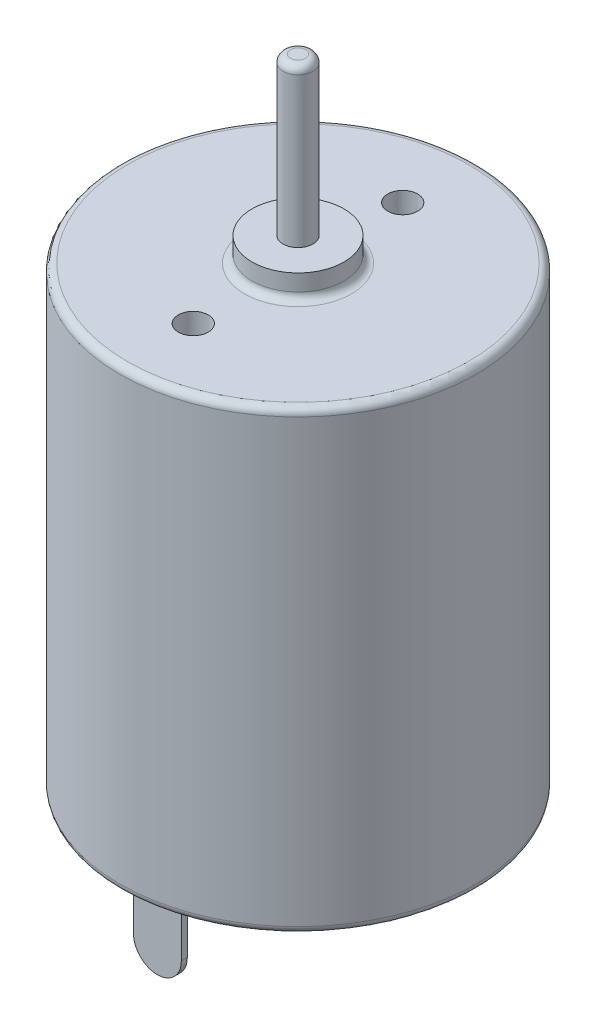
ISO-10303-21;
HEADER;
FILE_DESCRIPTION(('STEP AP214'),'2;1');
FILE_NAME('part.step','',(''),(''),'','','');
FILE_SCHEMA(('AUTOMOTIVE_DESIGN { 1 0 10303 214 1 1 1 1 }'));
ENDSEC;
DATA;
#1=APPLICATION_CONTEXT('core data for automotive mechanical design processes');
#2=APPLICATION_PROTOCOL_DEFINITION('international standard','automotive_design',2000,#1);
#3=PRODUCT_CONTEXT('',#1,'mechanical');
#4=PRODUCT('Part','Part','',(#3));
#5=PRODUCT_RELATED_PRODUCT_CATEGORY('part','',(#4));
#6=PRODUCT_DEFINITION_FORMATION('','',#4);
#7=PRODUCT_DEFINITION_CONTEXT('part definition',#1,'design');
#8=PRODUCT_DEFINITION('design','',#6,#7);
#9=PRODUCT_DEFINITION_SHAPE('','',#8);
#10=(LENGTH_UNIT() NAMED_UNIT(*) SI_UNIT(.MILLI.,.METRE.));
#11=(NAMED_UNIT(*) PLANE_ANGLE_UNIT() SI_UNIT($,.RADIAN.));
#12=(NAMED_UNIT(*) SI_UNIT($,.STERADIAN.) SOLID_ANGLE_UNIT());
#13=UNCERTAINTY_MEASURE_WITH_UNIT(LENGTH_MEASURE(1.E-05),#10,'distance_accuracy_value','');
#14=(GEOMETRIC_REPRESENTATION_CONTEXT(3) GLOBAL_UNCERTAINTY_ASSIGNED_CONTEXT((#13)) GLOBAL_UNIT_ASSIGNED_CONTEXT((#10,
#11,#12)) REPRESENTATION_CONTEXT('',''));
#15=CARTESIAN_POINT('',(0.,0.,0.));
#16=DIRECTION('',(0.,0.,1.));
#17=DIRECTION('',(1.,0.,0.));
#18=AXIS2_PLACEMENT_3D('',#15,#16,#17);
#19=CARTESIAN_POINT('',(0.,-6.,9.));
#20=DIRECTION('',(0.,0.,1.));
#21=DIRECTION('',(1.,0.,0.));
#22=AXIS2_PLACEMENT_3D('',#19,#20,#21);
#23=PLANE('',#22);
#24=DIRECTION('',(0.,1.,0.));
#25=VECTOR('',#24,1.);
#26=CARTESIAN_POINT('',(1.6,-6.,9.));
#27=LINE('',#26,#25);
#28=CARTESIAN_POINT('',(1.6,-4.4,9.));
#29=VERTEX_POINT('',#28);
#30=CARTESIAN_POINT('',(1.6,0.,9.));
#31=VERTEX_POINT('',#30);
#32=EDGE_CURVE('E187',#29,#31,#27,.T.);
#33=ORIENTED_EDGE('',*,*,#32,.F.);
#34=CARTESIAN_POINT('',(0.,-4.4,9.));
#35=DIRECTION('',(0.,0.,1.));
#36=DIRECTION('',(1.,0.,0.));
#37=AXIS2_PLACEMENT_3D('',#34,#35,#36);
#38=CIRCLE('',#37,1.6);
#39=CARTESIAN_POINT('',(-1.6,-4.4,9.));
#40=VERTEX_POINT('',#39);
#41=EDGE_CURVE('E155',#40,#29,#38,.T.);
#42=ORIENTED_EDGE('',*,*,#41,.F.);
#43=DIRECTION('',(0.,1.,0.));
#44=VECTOR('',#43,1.);
#45=CARTESIAN_POINT('',(-1.6,-6.,9.));
#46=LINE('',#45,#44);
#47=CARTESIAN_POINT('',(-1.6,0.,9.));
#48=VERTEX_POINT('',#47);
#49=EDGE_CURVE('E181',#40,#48,#46,.T.);
#50=ORIENTED_EDGE('',*,*,#49,.T.);
#51=DIRECTION('',(1.,0.,0.));
#52=VECTOR('',#51,1.);
#53=CARTESIAN_POINT('',(0.,0.,9.));
#54=LINE('',#53,#52);
#55=EDGE_CURVE('E169',#48,#31,#54,.T.);
#56=ORIENTED_EDGE('',*,*,#55,.T.);
#57=EDGE_LOOP('',(#33,#42,#50,#56));
#58=FACE_BOUND('',#57,.T.);
#59=ADVANCED_FACE('F57',(#58),#23,.F.);
#60=CARTESIAN_POINT('',(-1.6,-6.,9.4));
#61=DIRECTION('',(0.,0.,-1.));
#62=DIRECTION('',(-1.,0.,0.));
#63=AXIS2_PLACEMENT_3D('',#60,#61,#62);
#64=PLANE('',#63);
#65=CARTESIAN_POINT('',(0.,-4.4,9.4));
#66=DIRECTION('',(0.,0.,-1.));
#67=DIRECTION('',(-1.,0.,0.));
#68=AXIS2_PLACEMENT_3D('',#65,#66,#67);
#69=CIRCLE('',#68,1.6);
#70=CARTESIAN_POINT('',(1.6,-4.4,9.4));
#71=VERTEX_POINT('',#70);
#72=CARTESIAN_POINT('',(-1.6,-4.4,9.4));
#73=VERTEX_POINT('',#72);
#74=EDGE_CURVE('E315',#71,#73,#69,.T.);
#75=ORIENTED_EDGE('',*,*,#74,.F.);
#76=DIRECTION('',(0.,1.,0.));
#77=VECTOR('',#76,1.);
#78=CARTESIAN_POINT('',(1.6,-6.,9.4));
#79=LINE('',#78,#77);
#80=CARTESIAN_POINT('',(1.6,0.,9.4));
#81=VERTEX_POINT('',#80);
#82=EDGE_CURVE('E185',#71,#81,#79,.T.);
#83=ORIENTED_EDGE('',*,*,#82,.T.);
#84=DIRECTION('',(-1.,0.,0.));
#85=VECTOR('',#84,1.);
#86=CARTESIAN_POINT('',(-1.6,0.,9.4));
#87=LINE('',#86,#85);
#88=CARTESIAN_POINT('',(-1.6,0.,9.4));
#89=VERTEX_POINT('',#88);
#90=EDGE_CURVE('E175',#81,#89,#87,.T.);
#91=ORIENTED_EDGE('',*,*,#90,.T.);
#92=DIRECTION('',(0.,1.,0.));
#93=VECTOR('',#92,1.);
#94=CARTESIAN_POINT('',(-1.6,-6.,9.4));
#95=LINE('',#94,#93);
#96=EDGE_CURVE('E183',#73,#89,#95,.T.);
#97=ORIENTED_EDGE('',*,*,#96,.F.);
#98=EDGE_LOOP('',(#75,#83,#91,#97));
#99=FACE_BOUND('',#98,.T.);
#100=ADVANCED_FACE('F237',(#99),#64,.F.);
#101=CARTESIAN_POINT('',(-1.6,-6.,-9.4));
#102=DIRECTION('',(0.,0.,1.));
#103=DIRECTION('',(1.,0.,0.));
#104=AXIS2_PLACEMENT_3D('',#101,#102,#103);
#105=PLANE('',#104);
#106=DIRECTION('',(0.,1.,0.));
#107=VECTOR('',#106,1.);
#108=CARTESIAN_POINT('',(1.6,-6.,-9.4));
#109=LINE('',#108,#107);
#110=CARTESIAN_POINT('',(1.6,-4.4,-9.4));
#111=VERTEX_POINT('',#110);
#112=CARTESIAN_POINT('',(1.6,0.,-9.4));
#113=VERTEX_POINT('',#112);
#114=EDGE_CURVE('E80',#111,#113,#109,.T.);
#115=ORIENTED_EDGE('',*,*,#114,.F.);
#116=CARTESIAN_POINT('',(0.,-4.4,-9.4));
#117=DIRECTION('',(0.,0.,-1.));
#118=DIRECTION('',(-1.,0.,0.));
#119=AXIS2_PLACEMENT_3D('',#116,#117,#118);
#120=CIRCLE('',#119,1.6);
#121=CARTESIAN_POINT('',(-1.6,-4.4,-9.4));
#122=VERTEX_POINT('',#121);
#123=EDGE_CURVE('E137',#111,#122,#120,.T.);
#124=ORIENTED_EDGE('',*,*,#123,.T.);
#125=DIRECTION('',(0.,1.,0.));
#126=VECTOR('',#125,1.);
#127=CARTESIAN_POINT('',(-1.6,-6.,-9.4));
#128=LINE('',#127,#126);
#129=CARTESIAN_POINT('',(-1.6,0.,-9.4));
#130=VERTEX_POINT('',#129);
#131=EDGE_CURVE('E72',#122,#130,#128,.T.);
#132=ORIENTED_EDGE('',*,*,#131,.T.);
#133=DIRECTION('',(1.,0.,0.));
#134=VECTOR('',#133,1.);
#135=CARTESIAN_POINT('',(-1.6,0.,-9.4));
#136=LINE('',#135,#134);
#137=EDGE_CURVE('E151',#130,#113,#136,.T.);
#138=ORIENTED_EDGE('',*,*,#137,.T.);
#139=EDGE_LOOP('',(#115,#124,#132,#138));
#140=FACE_BOUND('',#139,.T.);
#141=ADVANCED_FACE('F150',(#140),#105,.F.);
#142=CARTESIAN_POINT('',(0.,-6.,-9.));
#143=DIRECTION('',(0.,0.,-1.));
#144=DIRECTION('',(-1.,0.,0.));
#145=AXIS2_PLACEMENT_3D('',#142,#143,#144);
#146=PLANE('',#145);
#147=CARTESIAN_POINT('',(0.,-4.4,-9.));
#148=DIRECTION('',(0.,0.,-1.));
#149=DIRECTION('',(-1.,0.,0.));
#150=AXIS2_PLACEMENT_3D('',#147,#148,#149);
#151=CIRCLE('',#150,1.6);
#152=CARTESIAN_POINT('',(1.6,-4.4,-9.));
#153=VERTEX_POINT('',#152);
#154=CARTESIAN_POINT('',(-1.6,-4.4,-9.));
#155=VERTEX_POINT('',#154);
#156=EDGE_CURVE('E313',#153,#155,#151,.T.);
#157=ORIENTED_EDGE('',*,*,#156,.F.);
#158=DIRECTION('',(0.,1.,0.));
#159=VECTOR('',#158,1.);
#160=CARTESIAN_POINT('',(1.6,-6.,-9.));
#161=LINE('',#160,#159);
#162=CARTESIAN_POINT('',(1.6,0.,-9.));
#163=VERTEX_POINT('',#162);
#164=EDGE_CURVE('E146',#153,#163,#161,.T.);
#165=ORIENTED_EDGE('',*,*,#164,.T.);
#166=DIRECTION('',(-1.,0.,0.));
#167=VECTOR('',#166,1.);
#168=CARTESIAN_POINT('',(0.,0.,-9.));
#169=LINE('',#168,#167);
#170=CARTESIAN_POINT('',(-1.6,0.,-9.));
#171=VERTEX_POINT('',#170);
#172=EDGE_CURVE('E160',#163,#171,#169,.T.);
#173=ORIENTED_EDGE('',*,*,#172,.T.);
#174=DIRECTION('',(0.,1.,0.));
#175=VECTOR('',#174,1.);
#176=CARTESIAN_POINT('',(-1.6,-6.,-9.));
#177=LINE('',#176,#175);
#178=EDGE_CURVE('E153',#155,#171,#177,.T.);
#179=ORIENTED_EDGE('',*,*,#178,.F.);
#180=EDGE_LOOP('',(#157,#165,#173,#179));
#181=FACE_BOUND('',#180,.T.);
#182=ADVANCED_FACE('F334',(#181),#146,.F.);
#183=CARTESIAN_POINT('',(-1.6,-6.,9.));
#184=DIRECTION('',(1.,0.,0.));
#185=DIRECTION('',(0.,0.,-1.));
#186=AXIS2_PLACEMENT_3D('',#183,#184,#185);
#187=PLANE('',#186);
#188=DIRECTION('',(0.,0.,-1.));
#189=VECTOR('',#188,1.);
#190=CARTESIAN_POINT('',(-1.6,-4.4,11.9));
#191=LINE('',#190,#189);
#192=EDGE_CURVE('E312',#73,#40,#191,.T.);
#193=ORIENTED_EDGE('',*,*,#192,.F.);
#194=ORIENTED_EDGE('',*,*,#96,.T.);
#195=DIRECTION('',(0.,0.,-1.));
#196=VECTOR('',#195,1.);
#197=CARTESIAN_POINT('',(-1.6,0.,9.));
#198=LINE('',#197,#196);
#199=EDGE_CURVE('E178',#89,#48,#198,.T.);
#200=ORIENTED_EDGE('',*,*,#199,.T.);
#201=ORIENTED_EDGE('',*,*,#49,.F.);
#202=EDGE_LOOP('',(#193,#194,#200,#201));
#203=FACE_BOUND('',#202,.T.);
#204=ADVANCED_FACE('F331',(#203),#187,.F.);
#205=CARTESIAN_POINT('',(-1.6,-6.,-9.));
#206=DIRECTION('',(1.,0.,0.));
#207=DIRECTION('',(0.,0.,-1.));
#208=AXIS2_PLACEMENT_3D('',#205,#206,#207);
#209=PLANE('',#208);
#210=EDGE_CURVE('E142',#155,#122,#191,.T.);
#211=ORIENTED_EDGE('',*,*,#210,.F.);
#212=ORIENTED_EDGE('',*,*,#178,.T.);
#213=DIRECTION('',(0.,0.,-1.));
#214=VECTOR('',#213,1.);
#215=CARTESIAN_POINT('',(-1.6,0.,-9.));
#216=LINE('',#215,#214);
#217=EDGE_CURVE('E166',#171,#130,#216,.T.);
#218=ORIENTED_EDGE('',*,*,#217,.T.);
#219=ORIENTED_EDGE('',*,*,#131,.F.);
#220=EDGE_LOOP('',(#211,#212,#218,#219));
#221=FACE_BOUND('',#220,.T.);
#222=ADVANCED_FACE('F269',(#221),#209,.F.);
#223=CARTESIAN_POINT('',(0.,0.,0.));
#224=DIRECTION('',(0.,1.,0.));
#225=DIRECTION('',(0.,0.,1.));
#226=AXIS2_PLACEMENT_3D('',#223,#224,#225);
#227=PLANE('',#226);
#228=CARTESIAN_POINT('',(0.,0.,0.));
#229=DIRECTION('',(0.,1.,0.));
#230=DIRECTION('',(0.,0.,1.));
#231=AXIS2_PLACEMENT_3D('',#228,#229,#230);
#232=CIRCLE('',#231,11.4);
#233=CARTESIAN_POINT('',(0.,0.,11.4));
#234=VERTEX_POINT('',#233);
#235=EDGE_CURVE('E216',#234,#234,#232,.F.);
#236=ORIENTED_EDGE('',*,*,#235,.T.);
#237=EDGE_LOOP('',(#236));
#238=FACE_BOUND('',#237,.T.);
#239=ORIENTED_EDGE('',*,*,#55,.F.);
#240=ORIENTED_EDGE('',*,*,#199,.F.);
#241=ORIENTED_EDGE('',*,*,#90,.F.);
#242=DIRECTION('',(0.,0.,1.));
#243=VECTOR('',#242,1.);
#244=CARTESIAN_POINT('',(1.6,0.,9.4));
#245=LINE('',#244,#243);
#246=EDGE_CURVE('E172',#31,#81,#245,.T.);
#247=ORIENTED_EDGE('',*,*,#246,.F.);
#248=EDGE_LOOP('',(#239,#240,#241,#247));
#249=FACE_BOUND('',#248,.T.);
#250=CARTESIAN_POINT('',(0.,0.,0.));
#251=DIRECTION('',(0.,-1.,0.));
#252=DIRECTION('',(0.,0.,-1.));
#253=AXIS2_PLACEMENT_3D('',#250,#251,#252);
#254=CIRCLE('',#253,4.25);
#255=CARTESIAN_POINT('',(3.75,0.,2.));
#256=VERTEX_POINT('',#255);
#257=CARTESIAN_POINT('',(3.75,0.,-2.));
#258=VERTEX_POINT('',#257);
#259=EDGE_CURVE('E194',#256,#258,#254,.T.);
#260=ORIENTED_EDGE('',*,*,#259,.F.);
#261=DIRECTION('',(0.,0.,-1.));
#262=VECTOR('',#261,1.);
#263=CARTESIAN_POINT('',(3.75,0.,0.));
#264=LINE('',#263,#262);
#265=EDGE_CURVE('E189',#256,#258,#264,.T.);
#266=ORIENTED_EDGE('',*,*,#265,.T.);
#267=EDGE_LOOP('',(#260,#266));
#268=FACE_BOUND('',#267,.T.);
#269=ORIENTED_EDGE('',*,*,#217,.F.);
#270=ORIENTED_EDGE('',*,*,#172,.F.);
#271=DIRECTION('',(0.,0.,1.));
#272=VECTOR('',#271,1.);
#273=CARTESIAN_POINT('',(1.6,0.,-9.4));
#274=LINE('',#273,#272);
#275=EDGE_CURVE('E163',#113,#163,#274,.T.);
#276=ORIENTED_EDGE('',*,*,#275,.F.);
#277=ORIENTED_EDGE('',*,*,#137,.F.);
#278=EDGE_LOOP('',(#269,#270,#276,#277));
#279=FACE_BOUND('',#278,.T.);
#280=ADVANCED_FACE('F266',(#238,#249,#268,#279),#227,.F.);
#281=CARTESIAN_POINT('',(0.,30.5,0.));
#282=DIRECTION('',(0.,-1.,0.));
#283=DIRECTION('',(0.,0.,-1.));
#284=AXIS2_PLACEMENT_3D('',#281,#282,#283);
#285=CYLINDRICAL_SURFACE('',#284,11.9);
#286=CARTESIAN_POINT('',(0.,0.5,0.));
#287=DIRECTION('',(0.,1.,0.));
#288=DIRECTION('',(0.,0.,1.));
#289=AXIS2_PLACEMENT_3D('',#286,#287,#288);
#290=CIRCLE('',#289,11.9);
#291=CARTESIAN_POINT('',(0.,0.499999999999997,-11.9));
#292=VERTEX_POINT('',#291);
#293=EDGE_CURVE('E213',#292,#292,#290,.T.);
#294=CARTESIAN_POINT('',(0.,30.,0.));
#295=DIRECTION('',(0.,1.,0.));
#296=DIRECTION('',(0.,0.,1.));
#297=AXIS2_PLACEMENT_3D('',#294,#295,#296);
#298=CIRCLE('',#297,11.9);
#299=CARTESIAN_POINT('',(0.,30.,-11.9));
#300=VERTEX_POINT('',#299);
#301=EDGE_CURVE('E210',#300,#300,#298,.F.);
#302=CARTESIAN_POINT('',(0.,0.499999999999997,-11.9));
#303=CARTESIAN_POINT('',(0.,0.807291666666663,-11.9));
#304=CARTESIAN_POINT('',(0.,1.11458333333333,-11.9));
#305=CARTESIAN_POINT('',(0.,1.72916666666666,-11.9));
#306=CARTESIAN_POINT('',(0.,2.03645833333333,-11.9));
#307=CARTESIAN_POINT('',(0.,2.65104166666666,-11.9));
#308=CARTESIAN_POINT('',(0.,2.95833333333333,-11.9));
#309=CARTESIAN_POINT('',(0.,3.57291666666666,-11.9));
#310=CARTESIAN_POINT('',(0.,3.88020833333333,-11.9));
#311=CARTESIAN_POINT('',(0.,4.49479166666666,-11.9));
#312=CARTESIAN_POINT('',(0.,4.80208333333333,-11.9));
#313=CARTESIAN_POINT('',(0.,5.41666666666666,-11.9));
#314=CARTESIAN_POINT('',(0.,5.72395833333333,-11.9));
#315=CARTESIAN_POINT('',(0.,6.33854166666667,-11.9));
#316=CARTESIAN_POINT('',(0.,6.64583333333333,-11.9));
#317=CARTESIAN_POINT('',(0.,7.26041666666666,-11.9));
#318=CARTESIAN_POINT('',(0.,7.56770833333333,-11.9));
#319=CARTESIAN_POINT('',(0.,8.18229166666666,-11.9));
#320=CARTESIAN_POINT('',(0.,8.48958333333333,-11.9));
#321=CARTESIAN_POINT('',(0.,9.10416666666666,-11.9));
#322=CARTESIAN_POINT('',(0.,9.41145833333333,-11.9));
#323=CARTESIAN_POINT('',(0.,10.0260416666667,-11.9));
#324=CARTESIAN_POINT('',(0.,10.3333333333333,-11.9));
#325=CARTESIAN_POINT('',(0.,10.9479166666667,-11.9));
#326=CARTESIAN_POINT('',(0.,11.2552083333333,-11.9));
#327=CARTESIAN_POINT('',(0.,11.8697916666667,-11.9));
#328=CARTESIAN_POINT('',(0.,12.1770833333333,-11.9));
#329=CARTESIAN_POINT('',(0.,12.7916666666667,-11.9));
#330=CARTESIAN_POINT('',(0.,13.0989583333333,-11.9));
#331=CARTESIAN_POINT('',(0.,13.7135416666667,-11.9));
#332=CARTESIAN_POINT('',(0.,14.0208333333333,-11.9));
#333=CARTESIAN_POINT('',(0.,14.6354166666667,-11.9));
#334=CARTESIAN_POINT('',(0.,14.9427083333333,-11.9));
#335=CARTESIAN_POINT('',(0.,15.5572916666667,-11.9));
#336=CARTESIAN_POINT('',(0.,15.8645833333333,-11.9));
#337=CARTESIAN_POINT('',(0.,16.4791666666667,-11.9));
#338=CARTESIAN_POINT('',(0.,16.7864583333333,-11.9));
#339=CARTESIAN_POINT('',(0.,17.4010416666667,-11.9));
#340=CARTESIAN_POINT('',(0.,17.7083333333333,-11.9));
#341=CARTESIAN_POINT('',(0.,18.3229166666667,-11.9));
#342=CARTESIAN_POINT('',(0.,18.6302083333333,-11.9));
#343=CARTESIAN_POINT('',(0.,19.2447916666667,-11.9));
#344=CARTESIAN_POINT('',(0.,19.5520833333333,-11.9));
#345=CARTESIAN_POINT('',(0.,20.1666666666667,-11.9));
#346=CARTESIAN_POINT('',(0.,20.4739583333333,-11.9));
#347=CARTESIAN_POINT('',(0.,21.0885416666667,-11.9));
#348=CARTESIAN_POINT('',(0.,21.3958333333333,-11.9));
#349=CARTESIAN_POINT('',(0.,22.0104166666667,-11.9));
#350=CARTESIAN_POINT('',(0.,22.3177083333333,-11.9));
#351=CARTESIAN_POINT('',(0.,22.9322916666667,-11.9));
#352=CARTESIAN_POINT('',(0.,23.2395833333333,-11.9));
#353=CARTESIAN_POINT('',(0.,23.8541666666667,-11.9));
#354=CARTESIAN_POINT('',(0.,24.1614583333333,-11.9));
#355=CARTESIAN_POINT('',(0.,24.7760416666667,-11.9));
#356=CARTESIAN_POINT('',(0.,25.0833333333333,-11.9));
#357=CARTESIAN_POINT('',(0.,25.6979166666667,-11.9));
#358=CARTESIAN_POINT('',(0.,26.0052083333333,-11.9));
#359=CARTESIAN_POINT('',(0.,26.6197916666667,-11.9));
#360=CARTESIAN_POINT('',(0.,26.9270833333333,-11.9));
#361=CARTESIAN_POINT('',(0.,27.5416666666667,-11.9));
#362=CARTESIAN_POINT('',(0.,27.8489583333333,-11.9));
#363=CARTESIAN_POINT('',(0.,28.4635416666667,-11.9));
#364=CARTESIAN_POINT('',(0.,28.7708333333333,-11.9));
#365=CARTESIAN_POINT('',(0.,29.3854166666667,-11.9));
#366=CARTESIAN_POINT('',(0.,29.6927083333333,-11.9));
#367=CARTESIAN_POINT('',(0.,30.,-11.9));
#368=B_SPLINE_CURVE_WITH_KNOTS('',3,(#302,#303,#304,#305,#306,#307,#308,#309,#310,#311,#312,
#313,#314,#315,#316,#317,#318,#319,#320,#321,#322,#323,#324,#325,#326,#327,#328,#329,#330,#331,
#332,#333,#334,#335,#336,#337,#338,#339,#340,#341,#342,#343,#344,#345,#346,#347,#348,#349,#350,
#351,#352,#353,#354,#355,#356,#357,#358,#359,#360,#361,#362,#363,#364,#365,#366,#367),
.UNSPECIFIED.,.F.,.F.,(4,2,2,2,2,2,2,2,2,2,2,2,2,2,2,2,2,2,2,2,2,2,2,2,2,2,2,2,2,2,2,2,4),(0.,
0.921874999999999,1.84375,2.765625,3.6875,4.609375,5.53125,6.453125,7.375,8.296875,9.21875,
10.140625,11.0625,11.984375,12.90625,13.828125,14.75,15.671875,16.59375,17.515625,18.4375,
19.359375,20.28125,21.203125,22.125,23.046875,23.96875,24.890625,25.8125,26.734375,27.65625,
28.578125,29.5),.UNSPECIFIED.);
#369=EDGE_CURVE('BSEAM264',#292,#300,#368,.T.);
#370=ORIENTED_EDGE('',*,*,#293,.T.);
#371=ORIENTED_EDGE('',*,*,#301,.T.);
#372=ORIENTED_EDGE('',*,*,#369,.T.);
#373=ORIENTED_EDGE('',*,*,#369,.F.);
#374=EDGE_LOOP('',(#370,#372,#371,#373));
#375=FACE_BOUND('',#374,.T.);
#376=ADVANCED_FACE('F264',(#375),#285,.T.);
#377=CARTESIAN_POINT('',(0.,30.5,0.));
#378=DIRECTION('',(0.,1.,0.));
#379=DIRECTION('',(0.,0.,1.));
#380=AXIS2_PLACEMENT_3D('',#377,#378,#379);
#381=PLANE('',#380);
#382=CARTESIAN_POINT('',(0.,30.5,0.));
#383=DIRECTION('',(0.,1.,0.));
#384=DIRECTION('',(0.,0.,1.));
#385=AXIS2_PLACEMENT_3D('',#382,#383,#384);
#386=CIRCLE('',#385,11.4);
#387=CARTESIAN_POINT('',(0.,30.5,11.4));
#388=VERTEX_POINT('',#387);
#389=EDGE_CURVE('E219',#388,#388,#386,.T.);
#390=ORIENTED_EDGE('',*,*,#389,.T.);
#391=EDGE_LOOP('',(#390));
#392=FACE_BOUND('',#391,.T.);
#393=CARTESIAN_POINT('',(0.,30.5,0.));
#394=DIRECTION('',(0.,1.,0.));
#395=DIRECTION('',(0.,0.,1.));
#396=AXIS2_PLACEMENT_3D('',#393,#394,#395);
#397=CIRCLE('',#396,3.575);
#398=CARTESIAN_POINT('',(0.,30.5,3.575));
#399=VERTEX_POINT('',#398);
#400=EDGE_CURVE('E207',#399,#399,#397,.F.);
#401=ORIENTED_EDGE('',*,*,#400,.T.);
#402=EDGE_LOOP('',(#401));
#403=FACE_BOUND('',#402,.T.);
#404=CARTESIAN_POINT('',(0.,30.5,-7.));
#405=DIRECTION('',(0.,1.,0.));
#406=DIRECTION('',(0.,0.,1.));
#407=AXIS2_PLACEMENT_3D('',#404,#405,#406);
#408=CIRCLE('',#407,1.);
#409=CARTESIAN_POINT('',(0.,30.5,-6.));
#410=VERTEX_POINT('',#409);
#411=EDGE_CURVE('E295',#410,#410,#408,.T.);
#412=ORIENTED_EDGE('',*,*,#411,.F.);
#413=EDGE_LOOP('',(#412));
#414=FACE_BOUND('',#413,.T.);
#415=CARTESIAN_POINT('',(0.,30.5,7.));
#416=DIRECTION('',(0.,1.,0.));
#417=DIRECTION('',(0.,0.,-1.));
#418=AXIS2_PLACEMENT_3D('',#415,#416,#417);
#419=CIRCLE('',#418,1.);
#420=CARTESIAN_POINT('',(0.,30.5,6.));
#421=VERTEX_POINT('',#420);
#422=EDGE_CURVE('E298',#421,#421,#419,.T.);
#423=ORIENTED_EDGE('',*,*,#422,.F.);
#424=EDGE_LOOP('',(#423));
#425=FACE_BOUND('',#424,.T.);
#426=ADVANCED_FACE('F260',(#392,#403,#414,#425),#381,.T.);
#427=CARTESIAN_POINT('',(3.75,-1.5,0.));
#428=DIRECTION('',(1.,0.,0.));
#429=DIRECTION('',(0.,0.,-1.));
#430=AXIS2_PLACEMENT_3D('',#427,#428,#429);
#431=PLANE('',#430);
#432=ORIENTED_EDGE('',*,*,#265,.F.);
#433=DIRECTION('',(0.,1.,0.));
#434=VECTOR('',#433,1.);
#435=CARTESIAN_POINT('',(3.75,-1.5,2.));
#436=LINE('',#435,#434);
#437=CARTESIAN_POINT('',(3.75,-1.5,2.));
#438=VERTEX_POINT('',#437);
#439=EDGE_CURVE('E148',#438,#256,#436,.T.);
#440=ORIENTED_EDGE('',*,*,#439,.F.);
#441=DIRECTION('',(0.,0.,-1.));
#442=VECTOR('',#441,1.);
#443=CARTESIAN_POINT('',(3.75,-1.5,0.));
#444=LINE('',#443,#442);
#445=CARTESIAN_POINT('',(3.75,-1.5,-2.));
#446=VERTEX_POINT('',#445);
#447=EDGE_CURVE('E190',#438,#446,#444,.T.);
#448=ORIENTED_EDGE('',*,*,#447,.T.);
#449=DIRECTION('',(0.,1.,0.));
#450=VECTOR('',#449,1.);
#451=CARTESIAN_POINT('',(3.75,-1.5,-2.));
#452=LINE('',#451,#450);
#453=EDGE_CURVE('E196',#446,#258,#452,.T.);
#454=ORIENTED_EDGE('',*,*,#453,.T.);
#455=EDGE_LOOP('',(#432,#440,#448,#454));
#456=FACE_BOUND('',#455,.T.);
#457=ADVANCED_FACE('F256',(#456),#431,.T.);
#458=CARTESIAN_POINT('',(0.,-1.5,0.));
#459=DIRECTION('',(0.,1.,0.));
#460=DIRECTION('',(0.,0.,1.));
#461=AXIS2_PLACEMENT_3D('',#458,#459,#460);
#462=CYLINDRICAL_SURFACE('',#461,4.25);
#463=ORIENTED_EDGE('',*,*,#259,.T.);
#464=ORIENTED_EDGE('',*,*,#453,.F.);
#465=CARTESIAN_POINT('',(0.,-1.5,0.));
#466=DIRECTION('',(0.,-1.,0.));
#467=DIRECTION('',(0.,0.,-1.));
#468=AXIS2_PLACEMENT_3D('',#465,#466,#467);
#469=CIRCLE('',#468,4.25);
#470=EDGE_CURVE('E193',#438,#446,#469,.T.);
#471=ORIENTED_EDGE('',*,*,#470,.F.);
#472=ORIENTED_EDGE('',*,*,#439,.T.);
#473=EDGE_LOOP('',(#463,#464,#471,#472));
#474=FACE_BOUND('',#473,.T.);
#475=ADVANCED_FACE('F252',(#474),#462,.T.);
#476=CARTESIAN_POINT('',(0.,-1.5,0.));
#477=DIRECTION('',(0.,-1.,0.));
#478=DIRECTION('',(0.,0.,-1.));
#479=AXIS2_PLACEMENT_3D('',#476,#477,#478);
#480=PLANE('',#479);
#481=ORIENTED_EDGE('',*,*,#447,.F.);
#482=ORIENTED_EDGE('',*,*,#470,.T.);
#483=EDGE_LOOP('',(#481,#482));
#484=FACE_BOUND('',#483,.T.);
#485=ADVANCED_FACE('F250',(#484),#480,.T.);
#486=CARTESIAN_POINT('',(1.6,-6.,9.4));
#487=DIRECTION('',(-1.,0.,0.));
#488=DIRECTION('',(0.,0.,1.));
#489=AXIS2_PLACEMENT_3D('',#486,#487,#488);
#490=PLANE('',#489);
#491=ORIENTED_EDGE('',*,*,#82,.F.);
#492=DIRECTION('',(0.,0.,-1.));
#493=VECTOR('',#492,1.);
#494=CARTESIAN_POINT('',(1.6,-4.4,11.9));
#495=LINE('',#494,#493);
#496=EDGE_CURVE('E143',#71,#29,#495,.T.);
#497=ORIENTED_EDGE('',*,*,#496,.T.);
#498=ORIENTED_EDGE('',*,*,#32,.T.);
#499=ORIENTED_EDGE('',*,*,#246,.T.);
#500=EDGE_LOOP('',(#491,#497,#498,#499));
#501=FACE_BOUND('',#500,.T.);
#502=ADVANCED_FACE('F249',(#501),#490,.F.);
#503=CARTESIAN_POINT('',(1.6,-6.,-9.4));
#504=DIRECTION('',(-1.,0.,0.));
#505=DIRECTION('',(0.,0.,1.));
#506=AXIS2_PLACEMENT_3D('',#503,#504,#505);
#507=PLANE('',#506);
#508=ORIENTED_EDGE('',*,*,#164,.F.);
#509=DIRECTION('',(0.,0.,-1.));
#510=VECTOR('',#509,1.);
#511=CARTESIAN_POINT('',(1.6,-4.4,11.9));
#512=LINE('',#511,#510);
#513=EDGE_CURVE('E139',#153,#111,#512,.T.);
#514=ORIENTED_EDGE('',*,*,#513,.T.);
#515=ORIENTED_EDGE('',*,*,#114,.T.);
#516=ORIENTED_EDGE('',*,*,#275,.T.);
#517=EDGE_LOOP('',(#508,#514,#515,#516));
#518=FACE_BOUND('',#517,.T.);
#519=ADVANCED_FACE('F145',(#518),#507,.F.);
#520=CARTESIAN_POINT('',(0.,-4.4,11.9));
#521=DIRECTION('',(0.,0.,-1.));
#522=DIRECTION('',(-1.,0.,0.));
#523=AXIS2_PLACEMENT_3D('',#520,#521,#522);
#524=CYLINDRICAL_SURFACE('',#523,1.6);
#525=ORIENTED_EDGE('',*,*,#156,.T.);
#526=ORIENTED_EDGE('',*,*,#210,.T.);
#527=ORIENTED_EDGE('',*,*,#123,.F.);
#528=ORIENTED_EDGE('',*,*,#513,.F.);
#529=EDGE_LOOP('',(#525,#526,#527,#528));
#530=FACE_BOUND('',#529,.T.);
#531=ADVANCED_FACE('F138',(#530),#524,.T.);
#532=ORIENTED_EDGE('',*,*,#41,.T.);
#533=ORIENTED_EDGE('',*,*,#496,.F.);
#534=ORIENTED_EDGE('',*,*,#74,.T.);
#535=ORIENTED_EDGE('',*,*,#192,.T.);
#536=EDGE_LOOP('',(#532,#533,#534,#535));
#537=FACE_BOUND('',#536,.T.);
#538=ADVANCED_FACE('F319',(#537),#524,.T.);
#539=CARTESIAN_POINT('',(0.,25.5,7.));
#540=DIRECTION('',(0.,1.,0.));
#541=DIRECTION('',(0.,0.,1.));
#542=AXIS2_PLACEMENT_3D('',#539,#540,#541);
#543=CYLINDRICAL_SURFACE('',#542,1.);
#544=CARTESIAN_POINT('',(0.,25.5,7.));
#545=DIRECTION('',(0.,1.,0.));
#546=DIRECTION('',(0.,0.,-1.));
#547=AXIS2_PLACEMENT_3D('',#544,#545,#546);
#548=CIRCLE('',#547,1.);
#549=CARTESIAN_POINT('',(0.,25.5,6.));
#550=VERTEX_POINT('',#549);
#551=EDGE_CURVE('E300',#550,#550,#548,.T.);
#552=ORIENTED_EDGE('',*,*,#551,.F.);
#553=EDGE_LOOP('',(#552));
#554=FACE_BOUND('',#553,.T.);
#555=ORIENTED_EDGE('',*,*,#422,.T.);
#556=EDGE_LOOP('',(#555));
#557=FACE_BOUND('',#556,.T.);
#558=ADVANCED_FACE('F351',(#554,#557),#543,.F.);
#559=CARTESIAN_POINT('',(0.,25.5,7.));
#560=DIRECTION('',(0.,-1.,0.));
#561=DIRECTION('',(0.,0.,-1.));
#562=AXIS2_PLACEMENT_3D('',#559,#560,#561);
#563=PLANE('',#562);
#564=ORIENTED_EDGE('',*,*,#551,.T.);
#565=EDGE_LOOP('',(#564));
#566=FACE_BOUND('',#565,.T.);
#567=ADVANCED_FACE('F352',(#566),#563,.F.);
#568=CARTESIAN_POINT('',(0.,25.5,-7.));
#569=DIRECTION('',(0.,1.,0.));
#570=DIRECTION('',(0.,0.,1.));
#571=AXIS2_PLACEMENT_3D('',#568,#569,#570);
#572=CYLINDRICAL_SURFACE('',#571,1.);
#573=CARTESIAN_POINT('',(0.,25.5,-7.));
#574=DIRECTION('',(0.,1.,0.));
#575=DIRECTION('',(0.,0.,1.));
#576=AXIS2_PLACEMENT_3D('',#573,#574,#575);
#577=CIRCLE('',#576,1.);
#578=CARTESIAN_POINT('',(0.,25.5,-6.));
#579=VERTEX_POINT('',#578);
#580=EDGE_CURVE('E302',#579,#579,#577,.T.);
#581=ORIENTED_EDGE('',*,*,#580,.F.);
#582=EDGE_LOOP('',(#581));
#583=FACE_BOUND('',#582,.T.);
#584=ORIENTED_EDGE('',*,*,#411,.T.);
#585=EDGE_LOOP('',(#584));
#586=FACE_BOUND('',#585,.T.);
#587=ADVANCED_FACE('F355',(#583,#586),#572,.F.);
#588=CARTESIAN_POINT('',(0.,25.5,-7.));
#589=DIRECTION('',(0.,1.,0.));
#590=DIRECTION('',(0.,0.,1.));
#591=AXIS2_PLACEMENT_3D('',#588,#589,#590);
#592=PLANE('',#591);
#593=ORIENTED_EDGE('',*,*,#580,.T.);
#594=EDGE_LOOP('',(#593));
#595=FACE_BOUND('',#594,.T.);
#596=ADVANCED_FACE('F362',(#595),#592,.T.);
#597=CARTESIAN_POINT('',(0.,32.1,0.));
#598=DIRECTION('',(0.,-1.,0.));
#599=DIRECTION('',(0.,0.,-1.));
#600=AXIS2_PLACEMENT_3D('',#597,#598,#599);
#601=CYLINDRICAL_SURFACE('',#600,3.075);
#602=CARTESIAN_POINT('',(0.,31.,0.));
#603=DIRECTION('',(0.,1.,0.));
#604=DIRECTION('',(0.,0.,1.));
#605=AXIS2_PLACEMENT_3D('',#602,#603,#604);
#606=CIRCLE('',#605,3.075);
#607=CARTESIAN_POINT('',(0.,31.,3.075));
#608=VERTEX_POINT('',#607);
#609=EDGE_CURVE('E204',#608,#608,#606,.T.);
#610=ORIENTED_EDGE('',*,*,#609,.T.);
#611=EDGE_LOOP('',(#610));
#612=FACE_BOUND('',#611,.T.);
#613=CARTESIAN_POINT('',(0.,32.1,0.));
#614=DIRECTION('',(0.,1.,0.));
#615=DIRECTION('',(0.,0.,1.));
#616=AXIS2_PLACEMENT_3D('',#613,#614,#615);
#617=CIRCLE('',#616,3.075);
#618=CARTESIAN_POINT('',(0.,32.1,3.075));
#619=VERTEX_POINT('',#618);
#620=EDGE_CURVE('E305',#619,#619,#617,.T.);
#621=ORIENTED_EDGE('',*,*,#620,.F.);
#622=EDGE_LOOP('',(#621));
#623=FACE_BOUND('',#622,.T.);
#624=ADVANCED_FACE('F366',(#612,#623),#601,.T.);
#625=CARTESIAN_POINT('',(0.,32.1,0.));
#626=DIRECTION('',(0.,1.,0.));
#627=DIRECTION('',(0.,0.,1.));
#628=AXIS2_PLACEMENT_3D('',#625,#626,#627);
#629=PLANE('',#628);
#630=CARTESIAN_POINT('',(0.,32.1,0.));
#631=DIRECTION('',(0.,1.,0.));
#632=DIRECTION('',(0.,0.,1.));
#633=AXIS2_PLACEMENT_3D('',#630,#631,#632);
#634=CIRCLE('',#633,1.);
#635=CARTESIAN_POINT('',(0.,32.1,-1.));
#636=VERTEX_POINT('',#635);
#637=EDGE_CURVE('E147',#636,#636,#634,.T.);
#638=ORIENTED_EDGE('',*,*,#637,.F.);
#639=EDGE_LOOP('',(#638));
#640=FACE_BOUND('',#639,.T.);
#641=ORIENTED_EDGE('',*,*,#620,.T.);
#642=EDGE_LOOP('',(#641));
#643=FACE_BOUND('',#642,.T.);
#644=ADVANCED_FACE('F370',(#640,#643),#629,.T.);
#645=CARTESIAN_POINT('',(0.,42.6,0.));
#646=DIRECTION('',(0.,-1.,0.));
#647=DIRECTION('',(0.,0.,-1.));
#648=AXIS2_PLACEMENT_3D('',#645,#646,#647);
#649=CYLINDRICAL_SURFACE('',#648,1.);
#650=CARTESIAN_POINT('',(0.,42.1,0.));
#651=DIRECTION('',(0.,1.,0.));
#652=DIRECTION('',(0.,0.,1.));
#653=AXIS2_PLACEMENT_3D('',#650,#651,#652);
#654=CIRCLE('',#653,1.);
#655=CARTESIAN_POINT('',(0.,42.1,-1.));
#656=VERTEX_POINT('',#655);
#657=EDGE_CURVE('E12',#656,#656,#654,.F.);
#658=CARTESIAN_POINT('',(0.,42.1,-1.));
#659=CARTESIAN_POINT('',(0.,41.9958333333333,-1.));
#660=CARTESIAN_POINT('',(0.,41.8916666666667,-1.));
#661=CARTESIAN_POINT('',(0.,41.6833333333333,-1.));
#662=CARTESIAN_POINT('',(0.,41.5791666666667,-1.));
#663=CARTESIAN_POINT('',(0.,41.3708333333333,-1.));
#664=CARTESIAN_POINT('',(0.,41.2666666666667,-1.));
#665=CARTESIAN_POINT('',(0.,41.0583333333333,-1.));
#666=CARTESIAN_POINT('',(0.,40.9541666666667,-1.));
#667=CARTESIAN_POINT('',(0.,40.7458333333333,-1.));
#668=CARTESIAN_POINT('',(0.,40.6416666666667,-1.));
#669=CARTESIAN_POINT('',(0.,40.4333333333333,-1.));
#670=CARTESIAN_POINT('',(0.,40.3291666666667,-1.));
#671=CARTESIAN_POINT('',(0.,40.1208333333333,-1.));
#672=CARTESIAN_POINT('',(0.,40.0166666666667,-1.));
#673=CARTESIAN_POINT('',(0.,39.8083333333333,-1.));
#674=CARTESIAN_POINT('',(0.,39.7041666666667,-1.));
#675=CARTESIAN_POINT('',(0.,39.4958333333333,-1.));
#676=CARTESIAN_POINT('',(0.,39.3916666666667,-1.));
#677=CARTESIAN_POINT('',(0.,39.1833333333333,-1.));
#678=CARTESIAN_POINT('',(0.,39.0791666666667,-1.));
#679=CARTESIAN_POINT('',(0.,38.8708333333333,-1.));
#680=CARTESIAN_POINT('',(0.,38.7666666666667,-1.));
#681=CARTESIAN_POINT('',(0.,38.5583333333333,-1.));
#682=CARTESIAN_POINT('',(0.,38.4541666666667,-1.));
#683=CARTESIAN_POINT('',(0.,38.2458333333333,-1.));
#684=CARTESIAN_POINT('',(0.,38.1416666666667,-1.));
#685=CARTESIAN_POINT('',(0.,37.9333333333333,-1.));
#686=CARTESIAN_POINT('',(0.,37.8291666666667,-1.));
#687=CARTESIAN_POINT('',(0.,37.6208333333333,-1.));
#688=CARTESIAN_POINT('',(0.,37.5166666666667,-1.));
#689=CARTESIAN_POINT('',(0.,37.3083333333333,-1.));
#690=CARTESIAN_POINT('',(0.,37.2041666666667,-1.));
#691=CARTESIAN_POINT('',(0.,36.9958333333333,-1.));
#692=CARTESIAN_POINT('',(0.,36.8916666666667,-1.));
#693=CARTESIAN_POINT('',(0.,36.6833333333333,-1.));
#694=CARTESIAN_POINT('',(0.,36.5791666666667,-1.));
#695=CARTESIAN_POINT('',(0.,36.3708333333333,-1.));
#696=CARTESIAN_POINT('',(0.,36.2666666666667,-1.));
#697=CARTESIAN_POINT('',(0.,36.0583333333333,-1.));
#698=CARTESIAN_POINT('',(0.,35.9541666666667,-1.));
#699=CARTESIAN_POINT('',(0.,35.7458333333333,-1.));
#700=CARTESIAN_POINT('',(0.,35.6416666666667,-1.));
#701=CARTESIAN_POINT('',(0.,35.4333333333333,-1.));
#702=CARTESIAN_POINT('',(0.,35.3291666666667,-1.));
#703=CARTESIAN_POINT('',(0.,35.1208333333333,-1.));
#704=CARTESIAN_POINT('',(0.,35.0166666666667,-1.));
#705=CARTESIAN_POINT('',(0.,34.8083333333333,-1.));
#706=CARTESIAN_POINT('',(0.,34.7041666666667,-1.));
#707=CARTESIAN_POINT('',(0.,34.4958333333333,-1.));
#708=CARTESIAN_POINT('',(0.,34.3916666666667,-1.));
#709=CARTESIAN_POINT('',(0.,34.1833333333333,-1.));
#710=CARTESIAN_POINT('',(0.,34.0791666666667,-1.));
#711=CARTESIAN_POINT('',(0.,33.8708333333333,-1.));
#712=CARTESIAN_POINT('',(0.,33.7666666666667,-1.));
#713=CARTESIAN_POINT('',(0.,33.5583333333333,-1.));
#714=CARTESIAN_POINT('',(0.,33.4541666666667,-1.));
#715=CARTESIAN_POINT('',(0.,33.2458333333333,-1.));
#716=CARTESIAN_POINT('',(0.,33.1416666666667,-1.));
#717=CARTESIAN_POINT('',(0.,32.9333333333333,-1.));
#718=CARTESIAN_POINT('',(0.,32.8291666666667,-1.));
#719=CARTESIAN_POINT('',(0.,32.6208333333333,-1.));
#720=CARTESIAN_POINT('',(0.,32.5166666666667,-1.));
#721=CARTESIAN_POINT('',(0.,32.3083333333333,-1.));
#722=CARTESIAN_POINT('',(0.,32.2041666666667,-1.));
#723=CARTESIAN_POINT('',(0.,32.1,-1.));
#724=B_SPLINE_CURVE_WITH_KNOTS('',3,(#658,#659,#660,#661,#662,#663,#664,#665,#666,#667,#668,
#669,#670,#671,#672,#673,#674,#675,#676,#677,#678,#679,#680,#681,#682,#683,#684,#685,#686,#687,
#688,#689,#690,#691,#692,#693,#694,#695,#696,#697,#698,#699,#700,#701,#702,#703,#704,#705,#706,
#707,#708,#709,#710,#711,#712,#713,#714,#715,#716,#717,#718,#719,#720,#721,#722,#723),
.UNSPECIFIED.,.F.,.F.,(4,2,2,2,2,2,2,2,2,2,2,2,2,2,2,2,2,2,2,2,2,2,2,2,2,2,2,2,2,2,2,2,4),(0.,
0.312499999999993,0.624999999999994,0.937499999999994,1.24999999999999,1.56249999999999,
1.87499999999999,2.1875,2.5,2.8125,3.125,3.4375,3.75,4.0625,4.375,4.6875,5.,5.3125,5.625,5.9375,
6.25,6.5625,6.875,7.1875,7.5,7.81249999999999,8.125,8.43749999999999,8.74999999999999,
9.06249999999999,9.37499999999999,9.68749999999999,9.99999999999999),.UNSPECIFIED.);
#725=EDGE_CURVE('BSEAM374',#656,#636,#724,.T.);
#726=ORIENTED_EDGE('',*,*,#657,.T.);
#727=ORIENTED_EDGE('',*,*,#637,.T.);
#728=ORIENTED_EDGE('',*,*,#725,.T.);
#729=ORIENTED_EDGE('',*,*,#725,.F.);
#730=EDGE_LOOP('',(#726,#728,#727,#729));
#731=FACE_BOUND('',#730,.T.);
#732=ADVANCED_FACE('F374',(#731),#649,.T.);
#733=CARTESIAN_POINT('',(0.,42.6,0.));
#734=DIRECTION('',(0.,1.,0.));
#735=DIRECTION('',(0.,0.,1.));
#736=AXIS2_PLACEMENT_3D('',#733,#734,#735);
#737=PLANE('',#736);
#738=CARTESIAN_POINT('',(0.,42.6,0.));
#739=DIRECTION('',(0.,1.,0.));
#740=DIRECTION('',(0.,0.,1.));
#741=AXIS2_PLACEMENT_3D('',#738,#739,#740);
#742=CIRCLE('',#741,0.5);
#743=CARTESIAN_POINT('',(0.,42.6,0.5));
#744=VERTEX_POINT('',#743);
#745=EDGE_CURVE('E65',#744,#744,#742,.T.);
#746=ORIENTED_EDGE('',*,*,#745,.T.);
#747=EDGE_LOOP('',(#746));
#748=FACE_BOUND('',#747,.T.);
#749=ADVANCED_FACE('F224',(#748),#737,.T.);
#750=CARTESIAN_POINT('',(0.,31.,0.));
#751=DIRECTION('',(0.,1.,0.));
#752=DIRECTION('',(0.,0.,1.));
#753=AXIS2_PLACEMENT_3D('',#750,#751,#752);
#754=TOROIDAL_SURFACE('',#753,3.575,0.5);
#755=ORIENTED_EDGE('',*,*,#400,.F.);
#756=EDGE_LOOP('',(#755));
#757=FACE_BOUND('',#756,.T.);
#758=ORIENTED_EDGE('',*,*,#609,.F.);
#759=EDGE_LOOP('',(#758));
#760=FACE_BOUND('',#759,.T.);
#761=ADVANCED_FACE('F274',(#757,#760),#754,.F.);
#762=CARTESIAN_POINT('',(0.,0.5,0.));
#763=DIRECTION('',(0.,1.,0.));
#764=DIRECTION('',(0.,0.,1.));
#765=AXIS2_PLACEMENT_3D('',#762,#763,#764);
#766=TOROIDAL_SURFACE('',#765,11.4,0.5);
#767=ORIENTED_EDGE('',*,*,#235,.F.);
#768=EDGE_LOOP('',(#767));
#769=FACE_BOUND('',#768,.T.);
#770=ORIENTED_EDGE('',*,*,#293,.F.);
#771=EDGE_LOOP('',(#770));
#772=FACE_BOUND('',#771,.T.);
#773=ADVANCED_FACE('F233',(#769,#772),#766,.T.);
#774=CARTESIAN_POINT('',(0.,30.,0.));
#775=DIRECTION('',(0.,1.,0.));
#776=DIRECTION('',(0.,0.,1.));
#777=AXIS2_PLACEMENT_3D('',#774,#775,#776);
#778=TOROIDAL_SURFACE('',#777,11.4,0.5);
#779=ORIENTED_EDGE('',*,*,#301,.F.);
#780=EDGE_LOOP('',(#779));
#781=FACE_BOUND('',#780,.T.);
#782=ORIENTED_EDGE('',*,*,#389,.F.);
#783=EDGE_LOOP('',(#782));
#784=FACE_BOUND('',#783,.T.);
#785=ADVANCED_FACE('F227',(#781,#784),#778,.T.);
#786=CARTESIAN_POINT('',(0.,42.1,0.));
#787=DIRECTION('',(0.,1.,0.));
#788=DIRECTION('',(0.,0.,1.));
#789=AXIS2_PLACEMENT_3D('',#786,#787,#788);
#790=DEGENERATE_TOROIDAL_SURFACE('',#789,0.5,0.5,.T.);
#791=ORIENTED_EDGE('',*,*,#657,.F.);
#792=EDGE_LOOP('',(#791));
#793=FACE_BOUND('',#792,.T.);
#794=ORIENTED_EDGE('',*,*,#745,.F.);
#795=EDGE_LOOP('',(#794));
#796=FACE_BOUND('',#795,.T.);
#797=ADVANCED_FACE('F59',(#793,#796),#790,.T.);
#798=CLOSED_SHELL('',(#59,#100,#141,#182,#204,#222,#280,#376,#426,#457,#475,#485,#502,#519,#531,
#538,#558,#567,#587,#596,#624,#644,#732,#749,#761,#773,#785,#797));
#799=MANIFOLD_SOLID_BREP('B2',#798);
#800=ADVANCED_BREP_SHAPE_REPRESENTATION('',(#18,#799),#14);
#801=SHAPE_DEFINITION_REPRESENTATION(#9,#800);
ENDSEC;
END-ISO-10303-21;
